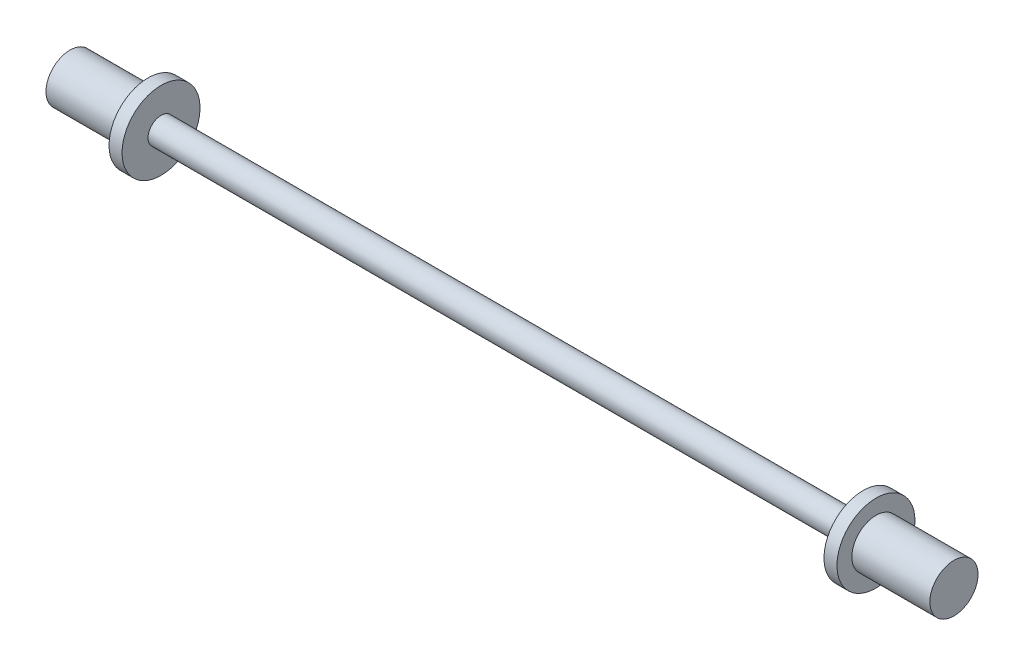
ISO-10303-21;
HEADER;
FILE_DESCRIPTION(('STEP AP214'),'2;1');
FILE_NAME('part.step','',(''),(''),'','','');
FILE_SCHEMA(('AUTOMOTIVE_DESIGN { 1 0 10303 214 1 1 1 1 }'));
ENDSEC;
DATA;
#1=APPLICATION_CONTEXT('core data for automotive mechanical design processes');
#2=APPLICATION_PROTOCOL_DEFINITION('international standard','automotive_design',2000,#1);
#3=PRODUCT_CONTEXT('',#1,'mechanical');
#4=PRODUCT('Part','Part','',(#3));
#5=PRODUCT_RELATED_PRODUCT_CATEGORY('part','',(#4));
#6=PRODUCT_DEFINITION_FORMATION('','',#4);
#7=PRODUCT_DEFINITION_CONTEXT('part definition',#1,'design');
#8=PRODUCT_DEFINITION('design','',#6,#7);
#9=PRODUCT_DEFINITION_SHAPE('','',#8);
#10=(LENGTH_UNIT() NAMED_UNIT(*) SI_UNIT(.MILLI.,.METRE.));
#11=(NAMED_UNIT(*) PLANE_ANGLE_UNIT() SI_UNIT($,.RADIAN.));
#12=(NAMED_UNIT(*) SI_UNIT($,.STERADIAN.) SOLID_ANGLE_UNIT());
#13=UNCERTAINTY_MEASURE_WITH_UNIT(LENGTH_MEASURE(1.E-05),#10,'distance_accuracy_value','');
#14=(GEOMETRIC_REPRESENTATION_CONTEXT(3) GLOBAL_UNCERTAINTY_ASSIGNED_CONTEXT((#13)) GLOBAL_UNIT_ASSIGNED_CONTEXT((#10,
#11,#12)) REPRESENTATION_CONTEXT('',''));
#15=CARTESIAN_POINT('',(0.,0.,0.));
#16=DIRECTION('',(0.,0.,1.));
#17=DIRECTION('',(1.,0.,0.));
#18=AXIS2_PLACEMENT_3D('',#15,#16,#17);
#19=CARTESIAN_POINT('',(-171.45,0.,0.));
#20=DIRECTION('',(1.,0.,0.));
#21=DIRECTION('',(0.,0.,-1.));
#22=AXIS2_PLACEMENT_3D('',#19,#20,#21);
#23=CYLINDRICAL_SURFACE('',#22,6.35);
#24=CARTESIAN_POINT('',(-171.45,0.,0.));
#25=DIRECTION('',(1.,0.,0.));
#26=DIRECTION('',(0.,0.,-1.));
#27=AXIS2_PLACEMENT_3D('',#24,#25,#26);
#28=CIRCLE('',#27,6.35);
#29=CARTESIAN_POINT('',(-171.45,0.,-6.35));
#30=VERTEX_POINT('',#29);
#31=EDGE_CURVE('E44',#30,#30,#28,.T.);
#32=ORIENTED_EDGE('',*,*,#31,.T.);
#33=EDGE_LOOP('',(#32));
#34=FACE_BOUND('',#33,.T.);
#35=CARTESIAN_POINT('',(171.45,0.,0.));
#36=DIRECTION('',(1.,0.,0.));
#37=DIRECTION('',(0.,0.,-1.));
#38=AXIS2_PLACEMENT_3D('',#35,#36,#37);
#39=CIRCLE('',#38,6.35);
#40=CARTESIAN_POINT('',(171.45,0.,-6.35));
#41=VERTEX_POINT('',#40);
#42=EDGE_CURVE('E53',#41,#41,#39,.T.);
#43=ORIENTED_EDGE('',*,*,#42,.F.);
#44=EDGE_LOOP('',(#43));
#45=FACE_BOUND('',#44,.T.);
#46=ADVANCED_FACE('F41',(#34,#45),#23,.T.);
#47=CARTESIAN_POINT('',(177.8,0.,0.));
#48=DIRECTION('',(-1.,0.,0.));
#49=DIRECTION('',(0.,0.,1.));
#50=AXIS2_PLACEMENT_3D('',#47,#48,#49);
#51=CYLINDRICAL_SURFACE('',#50,19.05);
#52=CARTESIAN_POINT('',(177.8,0.,0.));
#53=DIRECTION('',(1.,0.,0.));
#54=DIRECTION('',(0.,0.,-1.));
#55=AXIS2_PLACEMENT_3D('',#52,#53,#54);
#56=CIRCLE('',#55,19.05);
#57=CARTESIAN_POINT('',(177.8,0.,-19.05));
#58=VERTEX_POINT('',#57);
#59=EDGE_CURVE('E67',#58,#58,#56,.T.);
#60=ORIENTED_EDGE('',*,*,#59,.F.);
#61=EDGE_LOOP('',(#60));
#62=FACE_BOUND('',#61,.T.);
#63=CARTESIAN_POINT('',(171.45,0.,0.));
#64=DIRECTION('',(1.,0.,0.));
#65=DIRECTION('',(0.,0.,-1.));
#66=AXIS2_PLACEMENT_3D('',#63,#64,#65);
#67=CIRCLE('',#66,19.05);
#68=CARTESIAN_POINT('',(171.45,0.,-19.05));
#69=VERTEX_POINT('',#68);
#70=EDGE_CURVE('E70',#69,#69,#67,.T.);
#71=ORIENTED_EDGE('',*,*,#70,.T.);
#72=EDGE_LOOP('',(#71));
#73=FACE_BOUND('',#72,.T.);
#74=ADVANCED_FACE('F79',(#62,#73),#51,.T.);
#75=CARTESIAN_POINT('',(177.8,0.,0.));
#76=DIRECTION('',(1.,0.,0.));
#77=DIRECTION('',(0.,0.,-1.));
#78=AXIS2_PLACEMENT_3D('',#75,#76,#77);
#79=PLANE('',#78);
#80=CARTESIAN_POINT('',(177.8,0.,0.));
#81=DIRECTION('',(1.,0.,0.));
#82=DIRECTION('',(0.,0.,-1.));
#83=AXIS2_PLACEMENT_3D('',#80,#81,#82);
#84=CIRCLE('',#83,11.77);
#85=CARTESIAN_POINT('',(177.8,0.,11.77));
#86=VERTEX_POINT('',#85);
#87=EDGE_CURVE('E10',#86,#86,#84,.T.);
#88=ORIENTED_EDGE('',*,*,#87,.F.);
#89=EDGE_LOOP('',(#88));
#90=FACE_BOUND('',#89,.T.);
#91=ORIENTED_EDGE('',*,*,#59,.T.);
#92=EDGE_LOOP('',(#91));
#93=FACE_BOUND('',#92,.T.);
#94=ADVANCED_FACE('F84',(#90,#93),#79,.T.);
#95=CARTESIAN_POINT('',(171.45,0.,0.));
#96=DIRECTION('',(1.,0.,0.));
#97=DIRECTION('',(0.,0.,-1.));
#98=AXIS2_PLACEMENT_3D('',#95,#96,#97);
#99=PLANE('',#98);
#100=ORIENTED_EDGE('',*,*,#42,.T.);
#101=EDGE_LOOP('',(#100));
#102=FACE_BOUND('',#101,.T.);
#103=ORIENTED_EDGE('',*,*,#70,.F.);
#104=EDGE_LOOP('',(#103));
#105=FACE_BOUND('',#104,.T.);
#106=ADVANCED_FACE('F75',(#102,#105),#99,.F.);
#107=CARTESIAN_POINT('',(-177.8,0.,0.));
#108=DIRECTION('',(1.,0.,0.));
#109=DIRECTION('',(0.,0.,-1.));
#110=AXIS2_PLACEMENT_3D('',#107,#108,#109);
#111=CYLINDRICAL_SURFACE('',#110,19.05);
#112=CARTESIAN_POINT('',(-177.8,0.,0.));
#113=DIRECTION('',(-1.,0.,0.));
#114=DIRECTION('',(0.,0.,1.));
#115=AXIS2_PLACEMENT_3D('',#112,#113,#114);
#116=CIRCLE('',#115,19.05);
#117=CARTESIAN_POINT('',(-177.8,0.,19.05));
#118=VERTEX_POINT('',#117);
#119=EDGE_CURVE('E62',#118,#118,#116,.T.);
#120=ORIENTED_EDGE('',*,*,#119,.F.);
#121=EDGE_LOOP('',(#120));
#122=FACE_BOUND('',#121,.T.);
#123=CARTESIAN_POINT('',(-171.45,0.,0.));
#124=DIRECTION('',(-1.,0.,0.));
#125=DIRECTION('',(0.,0.,1.));
#126=AXIS2_PLACEMENT_3D('',#123,#124,#125);
#127=CIRCLE('',#126,19.05);
#128=CARTESIAN_POINT('',(-171.45,0.,19.05));
#129=VERTEX_POINT('',#128);
#130=EDGE_CURVE('E60',#129,#129,#127,.T.);
#131=ORIENTED_EDGE('',*,*,#130,.T.);
#132=EDGE_LOOP('',(#131));
#133=FACE_BOUND('',#132,.T.);
#134=ADVANCED_FACE('F97',(#122,#133),#111,.T.);
#135=CARTESIAN_POINT('',(-177.8,0.,0.));
#136=DIRECTION('',(-1.,0.,0.));
#137=DIRECTION('',(0.,0.,1.));
#138=AXIS2_PLACEMENT_3D('',#135,#136,#137);
#139=PLANE('',#138);
#140=CARTESIAN_POINT('',(-177.8,0.,0.));
#141=DIRECTION('',(-1.,0.,0.));
#142=DIRECTION('',(0.,0.,1.));
#143=AXIS2_PLACEMENT_3D('',#140,#141,#142);
#144=CIRCLE('',#143,11.77);
#145=CARTESIAN_POINT('',(-177.8,0.,-11.77));
#146=VERTEX_POINT('',#145);
#147=EDGE_CURVE('E48',#146,#146,#144,.T.);
#148=ORIENTED_EDGE('',*,*,#147,.F.);
#149=EDGE_LOOP('',(#148));
#150=FACE_BOUND('',#149,.T.);
#151=ORIENTED_EDGE('',*,*,#119,.T.);
#152=EDGE_LOOP('',(#151));
#153=FACE_BOUND('',#152,.T.);
#154=ADVANCED_FACE('F93',(#150,#153),#139,.T.);
#155=CARTESIAN_POINT('',(-171.45,0.,0.));
#156=DIRECTION('',(-1.,0.,0.));
#157=DIRECTION('',(0.,0.,1.));
#158=AXIS2_PLACEMENT_3D('',#155,#156,#157);
#159=PLANE('',#158);
#160=ORIENTED_EDGE('',*,*,#31,.F.);
#161=EDGE_LOOP('',(#160));
#162=FACE_BOUND('',#161,.T.);
#163=ORIENTED_EDGE('',*,*,#130,.F.);
#164=EDGE_LOOP('',(#163));
#165=FACE_BOUND('',#164,.T.);
#166=ADVANCED_FACE('F89',(#162,#165),#159,.F.);
#167=CARTESIAN_POINT('',(-215.9,0.,0.));
#168=DIRECTION('',(1.,0.,0.));
#169=DIRECTION('',(0.,0.,-1.));
#170=AXIS2_PLACEMENT_3D('',#167,#168,#169);
#171=CYLINDRICAL_SURFACE('',#170,11.77);
#172=CARTESIAN_POINT('',(-215.9,0.,0.));
#173=DIRECTION('',(-1.,0.,0.));
#174=DIRECTION('',(0.,0.,1.));
#175=AXIS2_PLACEMENT_3D('',#172,#173,#174);
#176=CIRCLE('',#175,11.77);
#177=CARTESIAN_POINT('',(-215.9,0.,-11.77));
#178=VERTEX_POINT('',#177);
#179=EDGE_CURVE('E58',#178,#178,#176,.T.);
#180=CARTESIAN_POINT('',(-215.9,0.,-11.77));
#181=CARTESIAN_POINT('',(-215.503125,0.,-11.77));
#182=CARTESIAN_POINT('',(-215.10625,0.,-11.77));
#183=CARTESIAN_POINT('',(-214.3125,0.,-11.77));
#184=CARTESIAN_POINT('',(-213.915625,0.,-11.77));
#185=CARTESIAN_POINT('',(-213.121875,0.,-11.77));
#186=CARTESIAN_POINT('',(-212.725,0.,-11.77));
#187=CARTESIAN_POINT('',(-211.93125,0.,-11.77));
#188=CARTESIAN_POINT('',(-211.534375,0.,-11.77));
#189=CARTESIAN_POINT('',(-210.740625,0.,-11.77));
#190=CARTESIAN_POINT('',(-210.34375,0.,-11.77));
#191=CARTESIAN_POINT('',(-209.55,0.,-11.77));
#192=CARTESIAN_POINT('',(-209.153125,0.,-11.77));
#193=CARTESIAN_POINT('',(-208.359375,0.,-11.77));
#194=CARTESIAN_POINT('',(-207.9625,0.,-11.77));
#195=CARTESIAN_POINT('',(-207.16875,0.,-11.77));
#196=CARTESIAN_POINT('',(-206.771875,0.,-11.77));
#197=CARTESIAN_POINT('',(-205.978125,0.,-11.77));
#198=CARTESIAN_POINT('',(-205.58125,0.,-11.77));
#199=CARTESIAN_POINT('',(-204.7875,0.,-11.77));
#200=CARTESIAN_POINT('',(-204.390625,0.,-11.77));
#201=CARTESIAN_POINT('',(-203.596875,0.,-11.77));
#202=CARTESIAN_POINT('',(-203.2,0.,-11.77));
#203=CARTESIAN_POINT('',(-202.40625,0.,-11.77));
#204=CARTESIAN_POINT('',(-202.009375,0.,-11.77));
#205=CARTESIAN_POINT('',(-201.215625,0.,-11.77));
#206=CARTESIAN_POINT('',(-200.81875,0.,-11.77));
#207=CARTESIAN_POINT('',(-200.025,0.,-11.77));
#208=CARTESIAN_POINT('',(-199.628125,0.,-11.77));
#209=CARTESIAN_POINT('',(-198.834375,0.,-11.77));
#210=CARTESIAN_POINT('',(-198.4375,0.,-11.77));
#211=CARTESIAN_POINT('',(-197.64375,0.,-11.77));
#212=CARTESIAN_POINT('',(-197.246875,0.,-11.77));
#213=CARTESIAN_POINT('',(-196.453125,0.,-11.77));
#214=CARTESIAN_POINT('',(-196.05625,0.,-11.77));
#215=CARTESIAN_POINT('',(-195.2625,0.,-11.77));
#216=CARTESIAN_POINT('',(-194.865625,0.,-11.77));
#217=CARTESIAN_POINT('',(-194.071875,0.,-11.77));
#218=CARTESIAN_POINT('',(-193.675,0.,-11.77));
#219=CARTESIAN_POINT('',(-192.88125,0.,-11.77));
#220=CARTESIAN_POINT('',(-192.484375,0.,-11.77));
#221=CARTESIAN_POINT('',(-191.690625,0.,-11.77));
#222=CARTESIAN_POINT('',(-191.29375,0.,-11.77));
#223=CARTESIAN_POINT('',(-190.5,0.,-11.77));
#224=CARTESIAN_POINT('',(-190.103125,0.,-11.77));
#225=CARTESIAN_POINT('',(-189.309375,0.,-11.77));
#226=CARTESIAN_POINT('',(-188.9125,0.,-11.77));
#227=CARTESIAN_POINT('',(-188.11875,0.,-11.77));
#228=CARTESIAN_POINT('',(-187.721875,0.,-11.77));
#229=CARTESIAN_POINT('',(-186.928125,0.,-11.77));
#230=CARTESIAN_POINT('',(-186.53125,0.,-11.77));
#231=CARTESIAN_POINT('',(-185.7375,0.,-11.77));
#232=CARTESIAN_POINT('',(-185.340625,0.,-11.77));
#233=CARTESIAN_POINT('',(-184.546875,0.,-11.77));
#234=CARTESIAN_POINT('',(-184.15,0.,-11.77));
#235=CARTESIAN_POINT('',(-183.35625,0.,-11.77));
#236=CARTESIAN_POINT('',(-182.959375,0.,-11.77));
#237=CARTESIAN_POINT('',(-182.165625,0.,-11.77));
#238=CARTESIAN_POINT('',(-181.76875,0.,-11.77));
#239=CARTESIAN_POINT('',(-180.975,0.,-11.77));
#240=CARTESIAN_POINT('',(-180.578125,0.,-11.77));
#241=CARTESIAN_POINT('',(-179.784375,0.,-11.77));
#242=CARTESIAN_POINT('',(-179.3875,0.,-11.77));
#243=CARTESIAN_POINT('',(-178.59375,0.,-11.77));
#244=CARTESIAN_POINT('',(-178.196875,0.,-11.77));
#245=CARTESIAN_POINT('',(-177.8,0.,-11.77));
#246=B_SPLINE_CURVE_WITH_KNOTS('',3,(#180,#181,#182,#183,#184,#185,#186,#187,#188,#189,#190,
#191,#192,#193,#194,#195,#196,#197,#198,#199,#200,#201,#202,#203,#204,#205,#206,#207,#208,#209,
#210,#211,#212,#213,#214,#215,#216,#217,#218,#219,#220,#221,#222,#223,#224,#225,#226,#227,#228,
#229,#230,#231,#232,#233,#234,#235,#236,#237,#238,#239,#240,#241,#242,#243,#244,#245),
.UNSPECIFIED.,.F.,.F.,(4,2,2,2,2,2,2,2,2,2,2,2,2,2,2,2,2,2,2,2,2,2,2,2,2,2,2,2,2,2,2,2,4),(0.,
1.19062499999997,2.38124999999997,3.57187499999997,4.76249999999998,5.95312499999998,
7.14374999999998,8.33437499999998,9.52499999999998,10.715625,11.90625,13.096875,14.2875,
15.478125,16.66875,17.859375,19.05,20.240625,21.43125,22.621875,23.8125,25.003125,26.19375,
27.384375,28.575,29.765625,30.95625,32.146875,33.3375,34.528125,35.71875,36.909375,38.1),.UNSPECIFIED.);
#247=EDGE_CURVE('BSEAM92',#178,#146,#246,.T.);
#248=ORIENTED_EDGE('',*,*,#179,.F.);
#249=ORIENTED_EDGE('',*,*,#147,.T.);
#250=ORIENTED_EDGE('',*,*,#247,.T.);
#251=ORIENTED_EDGE('',*,*,#247,.F.);
#252=EDGE_LOOP('',(#248,#250,#249,#251));
#253=FACE_BOUND('',#252,.T.);
#254=ADVANCED_FACE('F92',(#253),#171,.T.);
#255=CARTESIAN_POINT('',(-215.9,0.,0.));
#256=DIRECTION('',(-1.,0.,0.));
#257=DIRECTION('',(0.,0.,1.));
#258=AXIS2_PLACEMENT_3D('',#255,#256,#257);
#259=PLANE('',#258);
#260=ORIENTED_EDGE('',*,*,#179,.T.);
#261=EDGE_LOOP('',(#260));
#262=FACE_BOUND('',#261,.T.);
#263=ADVANCED_FACE('F125',(#262),#259,.T.);
#264=CARTESIAN_POINT('',(215.9,0.,0.));
#265=DIRECTION('',(-1.,0.,0.));
#266=DIRECTION('',(0.,0.,1.));
#267=AXIS2_PLACEMENT_3D('',#264,#265,#266);
#268=CYLINDRICAL_SURFACE('',#267,11.77);
#269=CARTESIAN_POINT('',(215.9,0.,0.));
#270=DIRECTION('',(1.,0.,0.));
#271=DIRECTION('',(0.,0.,-1.));
#272=AXIS2_PLACEMENT_3D('',#269,#270,#271);
#273=CIRCLE('',#272,11.77);
#274=CARTESIAN_POINT('',(215.9,0.,11.77));
#275=VERTEX_POINT('',#274);
#276=EDGE_CURVE('E57',#275,#275,#273,.T.);
#277=CARTESIAN_POINT('',(215.9,0.,11.77));
#278=CARTESIAN_POINT('',(215.503125,0.,11.77));
#279=CARTESIAN_POINT('',(215.10625,0.,11.77));
#280=CARTESIAN_POINT('',(214.3125,0.,11.77));
#281=CARTESIAN_POINT('',(213.915625,0.,11.77));
#282=CARTESIAN_POINT('',(213.121875,0.,11.77));
#283=CARTESIAN_POINT('',(212.725,0.,11.77));
#284=CARTESIAN_POINT('',(211.93125,0.,11.77));
#285=CARTESIAN_POINT('',(211.534375,0.,11.77));
#286=CARTESIAN_POINT('',(210.740625,0.,11.77));
#287=CARTESIAN_POINT('',(210.34375,0.,11.77));
#288=CARTESIAN_POINT('',(209.55,0.,11.77));
#289=CARTESIAN_POINT('',(209.153125,0.,11.77));
#290=CARTESIAN_POINT('',(208.359375,0.,11.77));
#291=CARTESIAN_POINT('',(207.9625,0.,11.77));
#292=CARTESIAN_POINT('',(207.16875,0.,11.77));
#293=CARTESIAN_POINT('',(206.771875,0.,11.77));
#294=CARTESIAN_POINT('',(205.978125,0.,11.77));
#295=CARTESIAN_POINT('',(205.58125,0.,11.77));
#296=CARTESIAN_POINT('',(204.7875,0.,11.77));
#297=CARTESIAN_POINT('',(204.390625,0.,11.77));
#298=CARTESIAN_POINT('',(203.596875,0.,11.77));
#299=CARTESIAN_POINT('',(203.2,0.,11.77));
#300=CARTESIAN_POINT('',(202.40625,0.,11.77));
#301=CARTESIAN_POINT('',(202.009375,0.,11.77));
#302=CARTESIAN_POINT('',(201.215625,0.,11.77));
#303=CARTESIAN_POINT('',(200.81875,0.,11.77));
#304=CARTESIAN_POINT('',(200.025,0.,11.77));
#305=CARTESIAN_POINT('',(199.628125,0.,11.77));
#306=CARTESIAN_POINT('',(198.834375,0.,11.77));
#307=CARTESIAN_POINT('',(198.4375,0.,11.77));
#308=CARTESIAN_POINT('',(197.64375,0.,11.77));
#309=CARTESIAN_POINT('',(197.246875,0.,11.77));
#310=CARTESIAN_POINT('',(196.453125,0.,11.77));
#311=CARTESIAN_POINT('',(196.05625,0.,11.77));
#312=CARTESIAN_POINT('',(195.2625,0.,11.77));
#313=CARTESIAN_POINT('',(194.865625,0.,11.77));
#314=CARTESIAN_POINT('',(194.071875,0.,11.77));
#315=CARTESIAN_POINT('',(193.675,0.,11.77));
#316=CARTESIAN_POINT('',(192.88125,0.,11.77));
#317=CARTESIAN_POINT('',(192.484375,0.,11.77));
#318=CARTESIAN_POINT('',(191.690625,0.,11.77));
#319=CARTESIAN_POINT('',(191.29375,0.,11.77));
#320=CARTESIAN_POINT('',(190.5,0.,11.77));
#321=CARTESIAN_POINT('',(190.103125,0.,11.77));
#322=CARTESIAN_POINT('',(189.309375,0.,11.77));
#323=CARTESIAN_POINT('',(188.9125,0.,11.77));
#324=CARTESIAN_POINT('',(188.11875,0.,11.77));
#325=CARTESIAN_POINT('',(187.721875,0.,11.77));
#326=CARTESIAN_POINT('',(186.928125,0.,11.77));
#327=CARTESIAN_POINT('',(186.53125,0.,11.77));
#328=CARTESIAN_POINT('',(185.7375,0.,11.77));
#329=CARTESIAN_POINT('',(185.340625,0.,11.77));
#330=CARTESIAN_POINT('',(184.546875,0.,11.77));
#331=CARTESIAN_POINT('',(184.15,0.,11.77));
#332=CARTESIAN_POINT('',(183.35625,0.,11.77));
#333=CARTESIAN_POINT('',(182.959375,0.,11.77));
#334=CARTESIAN_POINT('',(182.165625,0.,11.77));
#335=CARTESIAN_POINT('',(181.76875,0.,11.77));
#336=CARTESIAN_POINT('',(180.975,0.,11.77));
#337=CARTESIAN_POINT('',(180.578125,0.,11.77));
#338=CARTESIAN_POINT('',(179.784375,0.,11.77));
#339=CARTESIAN_POINT('',(179.3875,0.,11.77));
#340=CARTESIAN_POINT('',(178.59375,0.,11.77));
#341=CARTESIAN_POINT('',(178.196875,0.,11.77));
#342=CARTESIAN_POINT('',(177.8,0.,11.77));
#343=B_SPLINE_CURVE_WITH_KNOTS('',3,(#277,#278,#279,#280,#281,#282,#283,#284,#285,#286,#287,
#288,#289,#290,#291,#292,#293,#294,#295,#296,#297,#298,#299,#300,#301,#302,#303,#304,#305,#306,
#307,#308,#309,#310,#311,#312,#313,#314,#315,#316,#317,#318,#319,#320,#321,#322,#323,#324,#325,
#326,#327,#328,#329,#330,#331,#332,#333,#334,#335,#336,#337,#338,#339,#340,#341,#342),
.UNSPECIFIED.,.F.,.F.,(4,2,2,2,2,2,2,2,2,2,2,2,2,2,2,2,2,2,2,2,2,2,2,2,2,2,2,2,2,2,2,2,4),(0.,
1.19062499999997,2.38124999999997,3.57187499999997,4.76249999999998,5.95312499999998,
7.14374999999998,8.33437499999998,9.52499999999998,10.715625,11.90625,13.096875,14.2875,
15.478125,16.66875,17.859375,19.05,20.240625,21.43125,22.621875,23.8125,25.003125,26.19375,
27.384375,28.575,29.765625,30.95625,32.146875,33.3375,34.528125,35.71875,36.909375,38.1),.UNSPECIFIED.);
#344=EDGE_CURVE('BSEAM129',#275,#86,#343,.T.);
#345=ORIENTED_EDGE('',*,*,#276,.F.);
#346=ORIENTED_EDGE('',*,*,#87,.T.);
#347=ORIENTED_EDGE('',*,*,#344,.T.);
#348=ORIENTED_EDGE('',*,*,#344,.F.);
#349=EDGE_LOOP('',(#345,#347,#346,#348));
#350=FACE_BOUND('',#349,.T.);
#351=ADVANCED_FACE('F129',(#350),#268,.T.);
#352=CARTESIAN_POINT('',(215.9,0.,0.));
#353=DIRECTION('',(1.,0.,0.));
#354=DIRECTION('',(0.,0.,-1.));
#355=AXIS2_PLACEMENT_3D('',#352,#353,#354);
#356=PLANE('',#355);
#357=ORIENTED_EDGE('',*,*,#276,.T.);
#358=EDGE_LOOP('',(#357));
#359=FACE_BOUND('',#358,.T.);
#360=ADVANCED_FACE('F133',(#359),#356,.T.);
#361=CLOSED_SHELL('',(#46,#74,#94,#106,#134,#154,#166,#254,#263,#351,#360));
#362=MANIFOLD_SOLID_BREP('B2',#361);
#363=ADVANCED_BREP_SHAPE_REPRESENTATION('',(#18,#362),#14);
#364=SHAPE_DEFINITION_REPRESENTATION(#9,#363);
ENDSEC;
END-ISO-10303-21;
